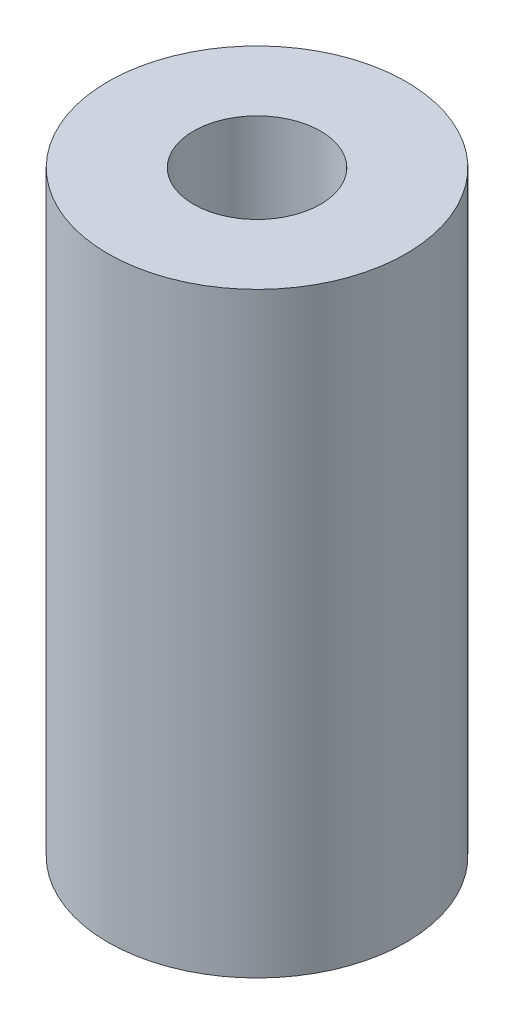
from build123d import *

# Parameters (mm, degrees)
SKETCH1_R             = 3.175
BOSS_EXTRUDE1_DEPTH   = 12.7
F_6_32_TAPPED_HOLE1_D = 2.7051


with BuildPart() as part:
    # Sketch1 → Boss-Extrude1 (new body)
    with BuildSketch(Plane(origin=(0, 0, 0), x_dir=(1, 0, 0), z_dir=(0, 1, 0))):
        with Locations(Location((0, 0, 0), (0, 0, 270))):
            Circle(SKETCH1_R)
    extrude(amount=BOSS_EXTRUDE1_DEPTH)

    # 6-32 Tapped Hole1 (through all)
    with Locations(Plane(origin=(0, 12.7, 0), x_dir=(-1, 0, 0), z_dir=(0, 1, 0))):
        with Locations((0, 0)):
            Hole(F_6_32_TAPPED_HOLE1_D / 2)


solid = part.part
